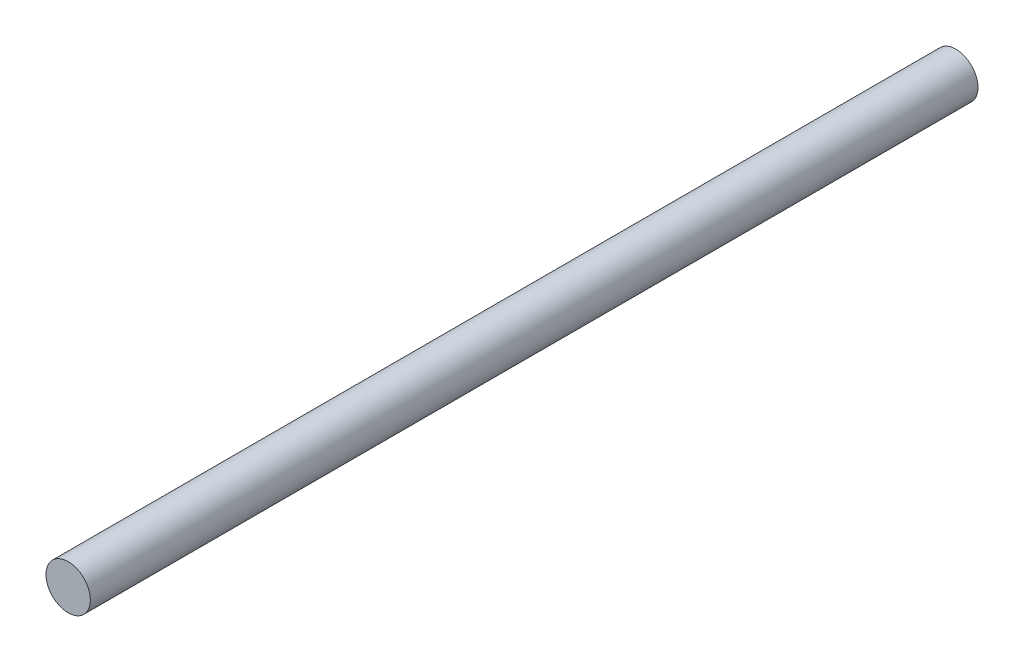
ISO-10303-21;
HEADER;
FILE_DESCRIPTION(('STEP AP214'),'2;1');
FILE_NAME('part.step','',(''),(''),'','','');
FILE_SCHEMA(('AUTOMOTIVE_DESIGN { 1 0 10303 214 1 1 1 1 }'));
ENDSEC;
DATA;
#1=APPLICATION_CONTEXT('core data for automotive mechanical design processes');
#2=APPLICATION_PROTOCOL_DEFINITION('international standard','automotive_design',2000,#1);
#3=PRODUCT_CONTEXT('',#1,'mechanical');
#4=PRODUCT('Part','Part','',(#3));
#5=PRODUCT_RELATED_PRODUCT_CATEGORY('part','',(#4));
#6=PRODUCT_DEFINITION_FORMATION('','',#4);
#7=PRODUCT_DEFINITION_CONTEXT('part definition',#1,'design');
#8=PRODUCT_DEFINITION('design','',#6,#7);
#9=PRODUCT_DEFINITION_SHAPE('','',#8);
#10=(LENGTH_UNIT() NAMED_UNIT(*) SI_UNIT(.MILLI.,.METRE.));
#11=(NAMED_UNIT(*) PLANE_ANGLE_UNIT() SI_UNIT($,.RADIAN.));
#12=(NAMED_UNIT(*) SI_UNIT($,.STERADIAN.) SOLID_ANGLE_UNIT());
#13=UNCERTAINTY_MEASURE_WITH_UNIT(LENGTH_MEASURE(1.E-05),#10,'distance_accuracy_value','');
#14=(GEOMETRIC_REPRESENTATION_CONTEXT(3) GLOBAL_UNCERTAINTY_ASSIGNED_CONTEXT((#13)) GLOBAL_UNIT_ASSIGNED_CONTEXT((#10,
#11,#12)) REPRESENTATION_CONTEXT('',''));
#15=CARTESIAN_POINT('',(0.,0.,0.));
#16=DIRECTION('',(0.,0.,1.));
#17=DIRECTION('',(1.,0.,0.));
#18=AXIS2_PLACEMENT_3D('',#15,#16,#17);
#19=CARTESIAN_POINT('',(0.,0.,320.));
#20=DIRECTION('',(0.,0.,-1.));
#21=DIRECTION('',(-1.,0.,0.));
#22=AXIS2_PLACEMENT_3D('',#19,#20,#21);
#23=CYLINDRICAL_SURFACE('',#22,8.);
#24=CARTESIAN_POINT('',(0.,0.,320.));
#25=DIRECTION('',(0.,0.,1.));
#26=DIRECTION('',(1.,0.,0.));
#27=AXIS2_PLACEMENT_3D('',#24,#25,#26);
#28=CIRCLE('',#27,8.);
#29=CARTESIAN_POINT('',(8.,0.,320.));
#30=VERTEX_POINT('',#29);
#31=EDGE_CURVE('E8',#30,#30,#28,.T.);
#32=ORIENTED_EDGE('',*,*,#31,.F.);
#33=EDGE_LOOP('',(#32));
#34=FACE_BOUND('',#33,.T.);
#35=CARTESIAN_POINT('',(0.,0.,0.));
#36=DIRECTION('',(0.,0.,1.));
#37=DIRECTION('',(1.,0.,0.));
#38=AXIS2_PLACEMENT_3D('',#35,#36,#37);
#39=CIRCLE('',#38,8.);
#40=CARTESIAN_POINT('',(8.,0.,0.));
#41=VERTEX_POINT('',#40);
#42=EDGE_CURVE('E18',#41,#41,#39,.T.);
#43=ORIENTED_EDGE('',*,*,#42,.T.);
#44=EDGE_LOOP('',(#43));
#45=FACE_BOUND('',#44,.T.);
#46=ADVANCED_FACE('F12',(#34,#45),#23,.T.);
#47=CARTESIAN_POINT('',(0.,0.,320.));
#48=DIRECTION('',(0.,0.,1.));
#49=DIRECTION('',(1.,0.,0.));
#50=AXIS2_PLACEMENT_3D('',#47,#48,#49);
#51=PLANE('',#50);
#52=ORIENTED_EDGE('',*,*,#31,.T.);
#53=EDGE_LOOP('',(#52));
#54=FACE_BOUND('',#53,.T.);
#55=ADVANCED_FACE('F27',(#54),#51,.T.);
#56=CARTESIAN_POINT('',(0.,0.,0.));
#57=DIRECTION('',(0.,0.,1.));
#58=DIRECTION('',(1.,0.,0.));
#59=AXIS2_PLACEMENT_3D('',#56,#57,#58);
#60=PLANE('',#59);
#61=ORIENTED_EDGE('',*,*,#42,.F.);
#62=EDGE_LOOP('',(#61));
#63=FACE_BOUND('',#62,.T.);
#64=ADVANCED_FACE('F25',(#63),#60,.F.);
#65=CLOSED_SHELL('',(#46,#55,#64));
#66=MANIFOLD_SOLID_BREP('B1',#65);
#67=ADVANCED_BREP_SHAPE_REPRESENTATION('',(#18,#66),#14);
#68=SHAPE_DEFINITION_REPRESENTATION(#9,#67);
ENDSEC;
END-ISO-10303-21;
